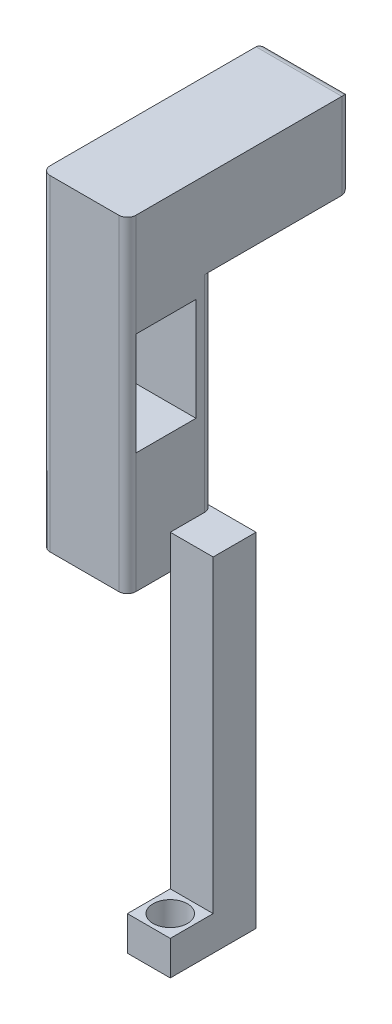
from build123d import *

# Parameters (mm, degrees)
SKETCH1_W           = 7.5
SKETCH1_H           = 5
BOSS_EXTRUDE1_DEPTH = 2
SKETCH2_W           = 5
SKETCH2_H           = 5
BOSS_EXTRUDE2_DEPTH = 17
SKETCH3_W           = 2.5
SKETCH3_H           = 5
BOSS_EXTRUDE3_DEPTH = 18
SKETCH4_W           = 2.5
SKETCH4_H           = 18
CUT_EXTRUDE1_DEPTH  = 2.5
CUT_EXTRUDE2_DEPTH  = 2.5
SKETCH6_W           = 5
SKETCH6_H           = 5
BOSS_EXTRUDE4_DEPTH = 8
FILLET1_R           = 0.5
SKETCH7_W           = 3.5
SKETCH7_H           = 6
CUT_EXTRUDE3_DEPTH  = 8


with BuildPart() as part:
    # Sketch1 → Boss-Extrude1 (new body)
    with BuildSketch(Plane(origin=(0, 0, 0), x_dir=(1, 0, 0), z_dir=(0, 1, 0))):
        Rectangle(SKETCH1_W, SKETCH1_H)
    extrude(amount=BOSS_EXTRUDE1_DEPTH)

    # Sketch2 → Boss-Extrude2 (add)
    with BuildSketch(Plane(origin=(0, 2, 0), x_dir=(1, 0, 0), z_dir=(0, 1, 0))):
        with Locations((-1.25, 0)):
            Rectangle(SKETCH2_W, SKETCH2_H)
    extrude(amount=BOSS_EXTRUDE2_DEPTH)

    # Sketch3 → Boss-Extrude3 (add)
    with BuildSketch(Plane.XZ):
        with Locations((2.5, 0)):
            Rectangle(SKETCH3_W, SKETCH3_H)
    extrude(amount=BOSS_EXTRUDE3_DEPTH)

    # Sketch4 → Cut-Extrude1 (cut)
    with BuildSketch(Plane(origin=(3.75, 0, 0), x_dir=(0, 0, -1), z_dir=(1, 0, 0))):
        with Locations((-1.25, -7)):
            Rectangle(SKETCH4_W, SKETCH4_H)
    extrude(amount=-CUT_EXTRUDE1_DEPTH, mode=Mode.SUBTRACT)

    # Sketch5 → Cut-Extrude2 (cut)
    with BuildSketch(Plane(origin=(0, -16, 0), x_dir=(1, 0, 0), z_dir=(0, 1, 0))):
        with BuildLine():
            ThreePointArc((1.5, -1.25), (2.5, -2.25), (3.5, -1.25))
            Line((3.5, -1.25), (1.5, -1.25))
        make_face()
        with BuildLine():
            Line((1.5, -1.25), (3.5, -1.25))
            ThreePointArc((3.5, -1.25), (2.5, -0.25), (1.5, -1.25))
        make_face()
        with BuildLine():
            ThreePointArc((1.5, -1.25), (2.5, -2.25), (3.5, -1.25))
            Line((3.5, -1.25), (1.5, -1.25))
        make_face()
        with BuildLine():
            Line((1.5, -1.25), (3.5, -1.25))
            ThreePointArc((3.5, -1.25), (2.5, -0.25), (1.5, -1.25))
        make_face()
    extrude(amount=-CUT_EXTRUDE2_DEPTH, mode=Mode.SUBTRACT)

    # Sketch6 → Boss-Extrude4 (add)
    with BuildSketch(Plane(origin=(0, 0, -2.5), x_dir=(-1, 0, 0), z_dir=(0, 0, -1))):
        with Locations((1.25, 16.5)):
            Rectangle(SKETCH6_W, SKETCH6_H)
    extrude(amount=BOSS_EXTRUDE4_DEPTH)

    # Fillet1
    fillet1_edges = [part.edges().sort_by_distance(p)[0] for p in [
        (1.25, 9.5, 2.5),
        (-3.75, 7, -2.5),
        (1.25, 8, -2.5),
        (-1.25, 14, -10.5),
        (-3.75, 16.5, -10.5),
        (-3.75, 9.5, 2.5),
        (-1.25, 19, -10.5),
        (1.25, 16.5, -10.5),
    ]]
    fillet(fillet1_edges, radius=FILLET1_R)

    # Sketch7 → Cut-Extrude3 (cut)
    with BuildSketch(Plane.ZY.offset(3.75)):
        with Locations((0.25, 10)):
            Rectangle(SKETCH7_W, SKETCH7_H)
    extrude(amount=-CUT_EXTRUDE3_DEPTH, mode=Mode.SUBTRACT)


solid = part.part
